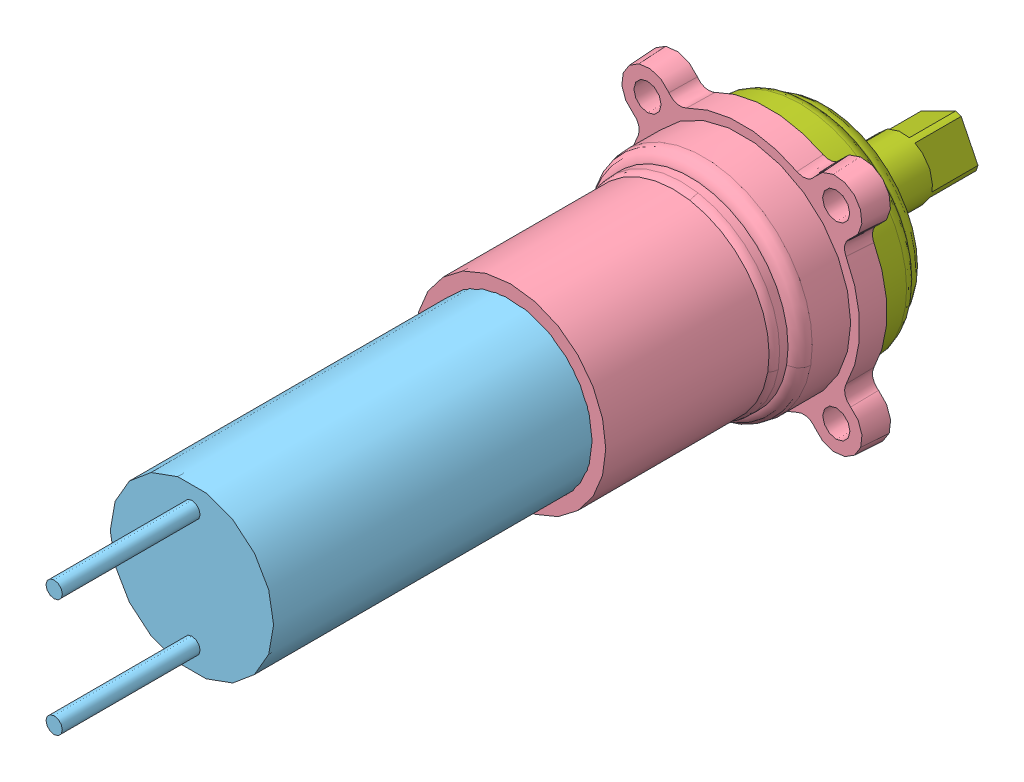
SolidWorks assembly GEARBOX.sldasm, configuration Default (file format 11000). Lengths in mm.
Overall size (8.94 8.94 32.86).
10 component instances, 7 part files, 11 mates.
Components (placement in the parent):
- Train Epicycloidale-1: Train Epicycloidale.SLDASM [Default] at (2.6229 11.623 10.4653) size (6.31 6.26 5)
  - porte satellite1-1: porte satellite1.SLDPRT [Défaut] at (-4.347 -5.3728 1.7604) size (5.7 5.7 5)
  - porte satellite 2a-1: porte satellite 2a.SLDPRT [Défaut] at (-4.347 -5.3728 1.7604) size (5.7 5.7 1.1)
  - SATELITE17X8a-1: SATELITE17X8a.SLDPRT [Défaut] at (-4.347 -5.3728 1.7604) size (2.84 2.83 4.1)
  - SATELITE17X8a-2: SATELITE17X8a.SLDPRT [Défaut] at (-7.817 -5.8833 1.7604) size (2.84 2.83 4.1)
  - SATELITE17X8a-3: SATELITE17X8a.SLDPRT [Défaut] at (-6.5241 -2.6229 1.7604) size (2.84 2.83 4.1)
- GEAR_A_44a-1: GEAR_A_44a.SLDPRT [Défaut] at (-1.7241 6.2502 12.1758) size (8.94 8.94 9.5)
- MOTORa-1: MOTORa.SLDPRT [Défaut] at (-1.7241 6.2502 12.1758) size (6 6 23.06)
- PINION_10a-1: PINION_10a.SLDPRT [Défaut] at (-1.7241 6.2502 12.1758) size (2 2 6)
- GEAR_B_25a-1: GEAR_B_25a.SLDPRT [Défaut] at (-1.7241 6.2502 12.4758) size (7.86 7.86 7)
Mates (geometry in assembly coordinates):
- Coaxiale1: concentric: cylinder of GEAR_A_44a-1 through (-1.7241 6.2502 25.6758) axis (0 0 1) radius 3; cylinder of MOTORa-1 through (-1.7241 6.2502 23.3758) axis (0 0 1) radius 3
- Coaxiale2: concentric: cylinder of PINION_10a-1 through (-1.7241 6.2502 23.0758) axis (0 0 1) radius 0.395; cylinder of MOTORa-1 through (-1.7241 6.2502 19.3758) axis (0 0 1) radius 0.4
- Coaxiale3: concentric: cylinder of Train Epicycloidale-1/porte satellite1-1 through (-1.7241 6.2502 15.8758) axis (0 0 1) radius 2.85; cylinder of GEAR_A_44a-1 through (-1.7241 6.2502 16.1758) axis (0 0 -1) radius 3.095
- Coaxiale5: concentric: cylinder of GEAR_B_25a-1 through (-1.7241 6.2502 16.5758) axis (0 0 -1) radius 3.9307; cylinder of GEAR_A_44a-1 through (-1.7241 6.2502 16.1758) axis (0 0 1) radius 4.33
- Coïncidente1: coincident: plane of GEAR_A_44a-1 through (-1.7241 6.2502 23.3758) normal (0 0 1); plane of MOTORa-1 through (1.2759 6.2502 23.3758) normal (0 0 -1)
- Coïncidente2: coincident: plane of MOTORa-1 through (-1.7241 6.2502 23.0758) normal (0 0 -1); plane of PINION_10a-1 through (-1.7241 6.2502 23.0758) normal (0 0 1)
- Coïncidente4: coincident: plane of Train Epicycloidale-1/porte satellite1-1 through (-1.7241 6.2502 19.0758) normal (0 0 1); plane of GEAR_A_44a-1 through (-1.7241 6.2502 19.0758) normal (0 0 -1)
- Coïncidente5: coincident: plane of Train Epicycloidale-1/porte satellite 2a-1 through (-1.7241 6.2502 14.7758) normal (0 0 -1); plane of GEAR_B_25a-1 through (-2.2234 6.2502 14.7758) normal (0 0 1)
- Contr.Engrenages1: gear = 1 mm: line of GEAR_A_44a-1 through (-3.832 9.038 17.1758) axis (0 0 1); line of Train Epicycloidale-1/SATELITE17X8a-3 through (-2.9982 8.8073 18.4258) axis (0 0 -1)
- Contr.Engrenages3: gear = 1 mm: line of Train Epicycloidale-1/SATELITE17X8a-2 through (-4.1341 4.647 15.4258) axis (0 0 1); line of GEAR_B_25a-1 through (-4.3858 3.9305 15.0758) axis (0 0 1)
- Contr.Engrenages4: gear = 1 mm: line of Train Epicycloidale-1/SATELITE17X8a-2 through (-2.2798 5.4412 18.4258) axis (0 0 -1); line of PINION_10a-1 through (-2.0846 5.8185 17.0758) axis (0 0 1)
